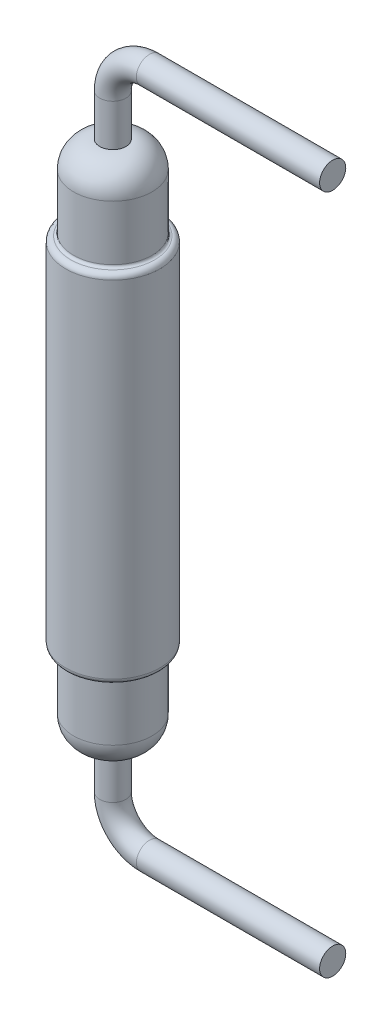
ISO-10303-21;
HEADER;
FILE_DESCRIPTION(('STEP AP214'),'2;1');
FILE_NAME('part.step','',(''),(''),'','','');
FILE_SCHEMA(('AUTOMOTIVE_DESIGN { 1 0 10303 214 1 1 1 1 }'));
ENDSEC;
DATA;
#1=APPLICATION_CONTEXT('core data for automotive mechanical design processes');
#2=APPLICATION_PROTOCOL_DEFINITION('international standard','automotive_design',2000,#1);
#3=PRODUCT_CONTEXT('',#1,'mechanical');
#4=PRODUCT('Part','Part','',(#3));
#5=PRODUCT_RELATED_PRODUCT_CATEGORY('part','',(#4));
#6=PRODUCT_DEFINITION_FORMATION('','',#4);
#7=PRODUCT_DEFINITION_CONTEXT('part definition',#1,'design');
#8=PRODUCT_DEFINITION('design','',#6,#7);
#9=PRODUCT_DEFINITION_SHAPE('','',#8);
#10=(LENGTH_UNIT() NAMED_UNIT(*) SI_UNIT(.MILLI.,.METRE.));
#11=(NAMED_UNIT(*) PLANE_ANGLE_UNIT() SI_UNIT($,.RADIAN.));
#12=(NAMED_UNIT(*) SI_UNIT($,.STERADIAN.) SOLID_ANGLE_UNIT());
#13=UNCERTAINTY_MEASURE_WITH_UNIT(LENGTH_MEASURE(1.E-05),#10,'distance_accuracy_value','');
#14=(GEOMETRIC_REPRESENTATION_CONTEXT(3) GLOBAL_UNCERTAINTY_ASSIGNED_CONTEXT((#13)) GLOBAL_UNIT_ASSIGNED_CONTEXT((#10,
#11,#12)) REPRESENTATION_CONTEXT('',''));
#15=CARTESIAN_POINT('',(0.,0.,0.));
#16=DIRECTION('',(0.,0.,1.));
#17=DIRECTION('',(1.,0.,0.));
#18=AXIS2_PLACEMENT_3D('',#15,#16,#17);
#19=CARTESIAN_POINT('',(0.,4.5,0.));
#20=DIRECTION('',(0.,-1.,0.));
#21=DIRECTION('',(0.,0.,-0.999999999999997));
#22=AXIS2_PLACEMENT_3D('',#19,#20,#21);
#23=DEGENERATE_TOROIDAL_SURFACE('',#22,0.25,0.5,.T.);
#24=CARTESIAN_POINT('',(0.,5.,0.));
#25=DIRECTION('',(0.,1.,0.));
#26=DIRECTION('',(0.,0.,0.999999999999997));
#27=AXIS2_PLACEMENT_3D('',#24,#25,#26);
#28=CIRCLE('',#27,0.25);
#29=CARTESIAN_POINT('',(0.,5.,0.249999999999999));
#30=VERTEX_POINT('',#29);
#31=EDGE_CURVE('E56',#30,#30,#28,.T.);
#32=ORIENTED_EDGE('',*,*,#31,.F.);
#33=EDGE_LOOP('',(#32));
#34=FACE_BOUND('',#33,.T.);
#35=CARTESIAN_POINT('',(0.,4.5,0.));
#36=DIRECTION('',(0.,-1.,0.));
#37=DIRECTION('',(0.,0.,-0.999999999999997));
#38=AXIS2_PLACEMENT_3D('',#35,#36,#37);
#39=CIRCLE('',#38,0.75);
#40=CARTESIAN_POINT('',(0.,4.5,-0.750000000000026));
#41=VERTEX_POINT('',#40);
#42=EDGE_CURVE('E34',#41,#41,#39,.T.);
#43=ORIENTED_EDGE('',*,*,#42,.F.);
#44=EDGE_LOOP('',(#43));
#45=FACE_BOUND('',#44,.T.);
#46=ADVANCED_FACE('F28',(#34,#45),#23,.T.);
#47=CARTESIAN_POINT('',(0.,0.,0.));
#48=DIRECTION('',(0.,-1.,0.));
#49=DIRECTION('',(0.,0.,-0.999999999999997));
#50=AXIS2_PLACEMENT_3D('',#47,#48,#49);
#51=CYLINDRICAL_SURFACE('',#50,0.75);
#52=ORIENTED_EDGE('',*,*,#42,.T.);
#53=EDGE_LOOP('',(#52));
#54=FACE_BOUND('',#53,.T.);
#55=CARTESIAN_POINT('',(0.,3.44999999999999,0.));
#56=DIRECTION('',(0.,-1.,0.));
#57=DIRECTION('',(0.,0.,-0.999999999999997));
#58=AXIS2_PLACEMENT_3D('',#55,#56,#57);
#59=CIRCLE('',#58,0.75);
#60=CARTESIAN_POINT('',(0.,3.44999999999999,-0.749999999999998));
#61=VERTEX_POINT('',#60);
#62=EDGE_CURVE('E38',#61,#61,#59,.T.);
#63=ORIENTED_EDGE('',*,*,#62,.F.);
#64=EDGE_LOOP('',(#63));
#65=FACE_BOUND('',#64,.T.);
#66=ADVANCED_FACE('F103',(#54,#65),#51,.T.);
#67=CARTESIAN_POINT('',(0.,3.44999999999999,0.));
#68=DIRECTION('',(0.,-1.,0.));
#69=DIRECTION('',(0.,0.,-0.999999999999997));
#70=AXIS2_PLACEMENT_3D('',#67,#68,#69);
#71=TOROIDAL_SURFACE('',#70,0.8,0.0500000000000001);
#72=ORIENTED_EDGE('',*,*,#62,.T.);
#73=EDGE_LOOP('',(#72));
#74=FACE_BOUND('',#73,.T.);
#75=CARTESIAN_POINT('',(0.,3.39999999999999,0.));
#76=DIRECTION('',(0.,-1.,0.));
#77=DIRECTION('',(0.,0.,-0.999999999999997));
#78=AXIS2_PLACEMENT_3D('',#75,#76,#77);
#79=CIRCLE('',#78,0.8);
#80=CARTESIAN_POINT('',(0.,3.39999999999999,-0.800000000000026));
#81=VERTEX_POINT('',#80);
#82=EDGE_CURVE('E42',#81,#81,#79,.T.);
#83=ORIENTED_EDGE('',*,*,#82,.F.);
#84=EDGE_LOOP('',(#83));
#85=FACE_BOUND('',#84,.T.);
#86=ADVANCED_FACE('F108',(#74,#85),#71,.F.);
#87=CARTESIAN_POINT('',(0.,0.,0.));
#88=DIRECTION('',(0.,-1.,0.));
#89=DIRECTION('',(0.,0.,-0.999999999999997));
#90=AXIS2_PLACEMENT_3D('',#87,#88,#89);
#91=CYLINDRICAL_SURFACE('',#90,0.9);
#92=CARTESIAN_POINT('',(0.,3.29999999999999,0.));
#93=DIRECTION('',(0.,1.,0.));
#94=DIRECTION('',(0.,0.,0.999999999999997));
#95=AXIS2_PLACEMENT_3D('',#92,#93,#94);
#96=CIRCLE('',#95,0.9);
#97=CARTESIAN_POINT('',(0.,3.29999999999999,0.899999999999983));
#98=VERTEX_POINT('',#97);
#99=EDGE_CURVE('E10',#98,#98,#96,.F.);
#100=ORIENTED_EDGE('',*,*,#99,.T.);
#101=EDGE_LOOP('',(#100));
#102=FACE_BOUND('',#101,.T.);
#103=CARTESIAN_POINT('',(0.,-3.30000000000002,0.));
#104=DIRECTION('',(0.,1.,0.));
#105=DIRECTION('',(0.,0.,0.999999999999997));
#106=AXIS2_PLACEMENT_3D('',#103,#104,#105);
#107=CIRCLE('',#106,0.9);
#108=CARTESIAN_POINT('',(0.,-3.30000000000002,0.899999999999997));
#109=VERTEX_POINT('',#108);
#110=EDGE_CURVE('E59',#109,#109,#107,.F.);
#111=ORIENTED_EDGE('',*,*,#110,.F.);
#112=EDGE_LOOP('',(#111));
#113=FACE_BOUND('',#112,.T.);
#114=ADVANCED_FACE('F136',(#102,#113),#91,.T.);
#115=CARTESIAN_POINT('',(0.,3.29999999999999,0.));
#116=DIRECTION('',(0.,1.,0.));
#117=DIRECTION('',(0.,0.,0.999999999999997));
#118=AXIS2_PLACEMENT_3D('',#115,#116,#117);
#119=TOROIDAL_SURFACE('',#118,0.8,0.1);
#120=ORIENTED_EDGE('',*,*,#82,.T.);
#121=EDGE_LOOP('',(#120));
#122=FACE_BOUND('',#121,.T.);
#123=ORIENTED_EDGE('',*,*,#99,.F.);
#124=EDGE_LOOP('',(#123));
#125=FACE_BOUND('',#124,.T.);
#126=ADVANCED_FACE('F132',(#122,#125),#119,.T.);
#127=CARTESIAN_POINT('',(0.699999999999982,6.49999999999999,0.));
#128=DIRECTION('',(0.999999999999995,0.,0.));
#129=DIRECTION('',(0.,0.,-0.999999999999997));
#130=AXIS2_PLACEMENT_3D('',#127,#128,#129);
#131=CYLINDRICAL_SURFACE('',#130,0.25);
#132=CARTESIAN_POINT('',(0.699999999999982,6.49999999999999,0.));
#133=DIRECTION('',(0.999999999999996,0.,0.));
#134=DIRECTION('',(0.,0.,0.999999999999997));
#135=AXIS2_PLACEMENT_3D('',#132,#133,#134);
#136=CIRCLE('',#135,0.25);
#137=CARTESIAN_POINT('',(0.699999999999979,6.75,0.));
#138=VERTEX_POINT('',#137);
#139=EDGE_CURVE('E50',#138,#138,#136,.T.);
#140=ORIENTED_EDGE('',*,*,#139,.T.);
#141=EDGE_LOOP('',(#140));
#142=FACE_BOUND('',#141,.T.);
#143=CARTESIAN_POINT('',(4.19999999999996,6.5,0.));
#144=DIRECTION('',(0.999999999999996,0.,0.));
#145=DIRECTION('',(0.,0.,0.999999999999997));
#146=AXIS2_PLACEMENT_3D('',#143,#144,#145);
#147=CIRCLE('',#146,0.25);
#148=CARTESIAN_POINT('',(4.19999999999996,6.5,0.249999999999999));
#149=VERTEX_POINT('',#148);
#150=EDGE_CURVE('E47',#149,#149,#147,.T.);
#151=ORIENTED_EDGE('',*,*,#150,.F.);
#152=EDGE_LOOP('',(#151));
#153=FACE_BOUND('',#152,.T.);
#154=ADVANCED_FACE('F124',(#142,#153),#131,.T.);
#155=CARTESIAN_POINT('',(0.699999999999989,5.8,0.));
#156=DIRECTION('',(0.,0.,-0.999999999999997));
#157=DIRECTION('',(-0.999999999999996,0.,0.));
#158=AXIS2_PLACEMENT_3D('',#155,#156,#157);
#159=TOROIDAL_SURFACE('',#158,0.7,0.25);
#160=CARTESIAN_POINT('',(0.,5.79999999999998,0.));
#161=DIRECTION('',(0.,1.,0.));
#162=DIRECTION('',(0.,0.,0.999999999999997));
#163=AXIS2_PLACEMENT_3D('',#160,#161,#162);
#164=CIRCLE('',#163,0.25);
#165=CARTESIAN_POINT('',(-0.250000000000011,5.79999999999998,0.));
#166=VERTEX_POINT('',#165);
#167=EDGE_CURVE('E53',#166,#166,#164,.T.);
#168=CARTESIAN_POINT('',(0.699999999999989,5.8,0.));
#169=DIRECTION('',(0.,0.,-0.999999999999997));
#170=DIRECTION('',(-0.999999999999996,0.,0.));
#171=AXIS2_PLACEMENT_3D('',#168,#169,#170);
#172=CIRCLE('',#171,0.95);
#173=EDGE_CURVE('',#166,#138,#172,.T.);
#174=ORIENTED_EDGE('',*,*,#167,.T.);
#175=ORIENTED_EDGE('',*,*,#139,.F.);
#176=ORIENTED_EDGE('',*,*,#173,.T.);
#177=ORIENTED_EDGE('',*,*,#173,.F.);
#178=EDGE_LOOP('',(#174,#176,#175,#177));
#179=FACE_BOUND('',#178,.T.);
#180=ADVANCED_FACE('F115',(#179),#159,.T.);
#181=CARTESIAN_POINT('',(0.,5.79999999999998,0.));
#182=DIRECTION('',(0.,-1.,0.));
#183=DIRECTION('',(0.,0.,-0.999999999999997));
#184=AXIS2_PLACEMENT_3D('',#181,#182,#183);
#185=CYLINDRICAL_SURFACE('',#184,0.25);
#186=ORIENTED_EDGE('',*,*,#167,.F.);
#187=EDGE_LOOP('',(#186));
#188=FACE_BOUND('',#187,.T.);
#189=ORIENTED_EDGE('',*,*,#31,.T.);
#190=EDGE_LOOP('',(#189));
#191=FACE_BOUND('',#190,.T.);
#192=ADVANCED_FACE('F112',(#188,#191),#185,.T.);
#193=CARTESIAN_POINT('',(4.19999999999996,6.5,0.));
#194=DIRECTION('',(0.999999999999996,0.,0.));
#195=DIRECTION('',(0.,0.,0.999999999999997));
#196=AXIS2_PLACEMENT_3D('',#193,#194,#195);
#197=PLANE('',#196);
#198=ORIENTED_EDGE('',*,*,#150,.T.);
#199=EDGE_LOOP('',(#198));
#200=FACE_BOUND('',#199,.T.);
#201=ADVANCED_FACE('F114',(#200),#197,.T.);
#202=CARTESIAN_POINT('',(0.,-4.50000000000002,0.));
#203=DIRECTION('',(0.,1.,0.));
#204=DIRECTION('',(0.,0.,-0.999999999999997));
#205=AXIS2_PLACEMENT_3D('',#202,#203,#204);
#206=DEGENERATE_TOROIDAL_SURFACE('',#205,0.25,0.5,.T.);
#207=CARTESIAN_POINT('',(0.,-5.00000000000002,0.));
#208=DIRECTION('',(0.,1.,0.));
#209=DIRECTION('',(0.,0.,0.999999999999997));
#210=AXIS2_PLACEMENT_3D('',#207,#208,#209);
#211=CIRCLE('',#210,0.25);
#212=CARTESIAN_POINT('',(0.,-5.00000000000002,0.249999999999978));
#213=VERTEX_POINT('',#212);
#214=EDGE_CURVE('E80',#213,#213,#211,.T.);
#215=ORIENTED_EDGE('',*,*,#214,.T.);
#216=EDGE_LOOP('',(#215));
#217=FACE_BOUND('',#216,.T.);
#218=CARTESIAN_POINT('',(0.,-4.50000000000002,0.));
#219=DIRECTION('',(0.,-1.,0.));
#220=DIRECTION('',(0.,0.,-0.999999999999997));
#221=AXIS2_PLACEMENT_3D('',#218,#219,#220);
#222=CIRCLE('',#221,0.75);
#223=CARTESIAN_POINT('',(0.,-4.50000000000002,-0.750000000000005));
#224=VERTEX_POINT('',#223);
#225=EDGE_CURVE('E62',#224,#224,#222,.T.);
#226=ORIENTED_EDGE('',*,*,#225,.T.);
#227=EDGE_LOOP('',(#226));
#228=FACE_BOUND('',#227,.T.);
#229=ADVANCED_FACE('F84',(#217,#228),#206,.T.);
#230=CARTESIAN_POINT('',(0.,0.,0.));
#231=DIRECTION('',(0.,1.,0.));
#232=DIRECTION('',(0.,0.,-0.999999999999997));
#233=AXIS2_PLACEMENT_3D('',#230,#231,#232);
#234=CYLINDRICAL_SURFACE('',#233,0.75);
#235=ORIENTED_EDGE('',*,*,#225,.F.);
#236=EDGE_LOOP('',(#235));
#237=FACE_BOUND('',#236,.T.);
#238=CARTESIAN_POINT('',(0.,-3.45000000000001,0.));
#239=DIRECTION('',(0.,-1.,0.));
#240=DIRECTION('',(0.,0.,-0.999999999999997));
#241=AXIS2_PLACEMENT_3D('',#238,#239,#240);
#242=CIRCLE('',#241,0.75);
#243=CARTESIAN_POINT('',(0.,-3.45000000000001,-0.750000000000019));
#244=VERTEX_POINT('',#243);
#245=EDGE_CURVE('E65',#244,#244,#242,.T.);
#246=ORIENTED_EDGE('',*,*,#245,.T.);
#247=EDGE_LOOP('',(#246));
#248=FACE_BOUND('',#247,.T.);
#249=ADVANCED_FACE('F186',(#237,#248),#234,.T.);
#250=CARTESIAN_POINT('',(0.,-3.45000000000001,0.));
#251=DIRECTION('',(0.,1.,0.));
#252=DIRECTION('',(0.,0.,-0.999999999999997));
#253=AXIS2_PLACEMENT_3D('',#250,#251,#252);
#254=TOROIDAL_SURFACE('',#253,0.8,0.0500000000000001);
#255=ORIENTED_EDGE('',*,*,#245,.F.);
#256=EDGE_LOOP('',(#255));
#257=FACE_BOUND('',#256,.T.);
#258=CARTESIAN_POINT('',(0.,-3.40000000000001,0.));
#259=DIRECTION('',(0.,-1.,0.));
#260=DIRECTION('',(0.,0.,-0.999999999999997));
#261=AXIS2_PLACEMENT_3D('',#258,#259,#260);
#262=CIRCLE('',#261,0.8);
#263=CARTESIAN_POINT('',(0.,-3.40000000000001,-0.800000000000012));
#264=VERTEX_POINT('',#263);
#265=EDGE_CURVE('E68',#264,#264,#262,.T.);
#266=ORIENTED_EDGE('',*,*,#265,.T.);
#267=EDGE_LOOP('',(#266));
#268=FACE_BOUND('',#267,.T.);
#269=ADVANCED_FACE('F194',(#257,#268),#254,.F.);
#270=CARTESIAN_POINT('',(0.,-3.30000000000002,0.));
#271=DIRECTION('',(0.,-1.,0.));
#272=DIRECTION('',(0.,0.,0.999999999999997));
#273=AXIS2_PLACEMENT_3D('',#270,#271,#272);
#274=TOROIDAL_SURFACE('',#273,0.8,0.1);
#275=ORIENTED_EDGE('',*,*,#265,.F.);
#276=EDGE_LOOP('',(#275));
#277=FACE_BOUND('',#276,.T.);
#278=ORIENTED_EDGE('',*,*,#110,.T.);
#279=EDGE_LOOP('',(#278));
#280=FACE_BOUND('',#279,.T.);
#281=ADVANCED_FACE('F204',(#277,#280),#274,.T.);
#282=CARTESIAN_POINT('',(0.700000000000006,-6.50000000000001,0.));
#283=DIRECTION('',(0.999999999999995,0.,0.));
#284=DIRECTION('',(0.,0.,-0.999999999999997));
#285=AXIS2_PLACEMENT_3D('',#282,#283,#284);
#286=CYLINDRICAL_SURFACE('',#285,0.25);
#287=CARTESIAN_POINT('',(0.700000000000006,-6.50000000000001,0.));
#288=DIRECTION('',(-0.999999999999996,0.,0.));
#289=DIRECTION('',(0.,0.,0.999999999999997));
#290=AXIS2_PLACEMENT_3D('',#287,#288,#289);
#291=CIRCLE('',#290,0.25);
#292=CARTESIAN_POINT('',(0.700000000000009,-6.75000000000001,0.));
#293=VERTEX_POINT('',#292);
#294=EDGE_CURVE('E74',#293,#293,#291,.T.);
#295=ORIENTED_EDGE('',*,*,#294,.F.);
#296=EDGE_LOOP('',(#295));
#297=FACE_BOUND('',#296,.T.);
#298=CARTESIAN_POINT('',(4.19999999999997,-6.50000000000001,0.));
#299=DIRECTION('',(-0.999999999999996,0.,0.));
#300=DIRECTION('',(0.,0.,0.999999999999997));
#301=AXIS2_PLACEMENT_3D('',#298,#299,#300);
#302=CIRCLE('',#301,0.25);
#303=CARTESIAN_POINT('',(4.19999999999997,-6.50000000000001,0.249999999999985));
#304=VERTEX_POINT('',#303);
#305=EDGE_CURVE('E71',#304,#304,#302,.T.);
#306=ORIENTED_EDGE('',*,*,#305,.T.);
#307=EDGE_LOOP('',(#306));
#308=FACE_BOUND('',#307,.T.);
#309=ADVANCED_FACE('F99',(#297,#308),#286,.T.);
#310=CARTESIAN_POINT('',(0.699999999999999,-5.80000000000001,0.));
#311=DIRECTION('',(0.,0.,-0.999999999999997));
#312=DIRECTION('',(-0.999999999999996,0.,0.));
#313=AXIS2_PLACEMENT_3D('',#310,#311,#312);
#314=TOROIDAL_SURFACE('',#313,0.7,0.25);
#315=CARTESIAN_POINT('',(0.,-5.80000000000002,0.));
#316=DIRECTION('',(0.,1.,0.));
#317=DIRECTION('',(0.,0.,0.999999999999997));
#318=AXIS2_PLACEMENT_3D('',#315,#316,#317);
#319=CIRCLE('',#318,0.25);
#320=CARTESIAN_POINT('',(-0.250000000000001,-5.80000000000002,0.));
#321=VERTEX_POINT('',#320);
#322=EDGE_CURVE('E77',#321,#321,#319,.T.);
#323=CARTESIAN_POINT('',(0.699999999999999,-5.80000000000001,0.));
#324=DIRECTION('',(0.,0.,-0.999999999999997));
#325=DIRECTION('',(-0.999999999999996,0.,0.));
#326=AXIS2_PLACEMENT_3D('',#323,#324,#325);
#327=CIRCLE('',#326,0.95);
#328=EDGE_CURVE('',#293,#321,#327,.T.);
#329=ORIENTED_EDGE('',*,*,#294,.T.);
#330=ORIENTED_EDGE('',*,*,#322,.F.);
#331=ORIENTED_EDGE('',*,*,#328,.T.);
#332=ORIENTED_EDGE('',*,*,#328,.F.);
#333=EDGE_LOOP('',(#329,#331,#330,#332));
#334=FACE_BOUND('',#333,.T.);
#335=ADVANCED_FACE('F90',(#334),#314,.T.);
#336=CARTESIAN_POINT('',(0.,-5.80000000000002,0.));
#337=DIRECTION('',(0.,1.,0.));
#338=DIRECTION('',(0.,0.,-0.999999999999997));
#339=AXIS2_PLACEMENT_3D('',#336,#337,#338);
#340=CYLINDRICAL_SURFACE('',#339,0.25);
#341=ORIENTED_EDGE('',*,*,#322,.T.);
#342=EDGE_LOOP('',(#341));
#343=FACE_BOUND('',#342,.T.);
#344=ORIENTED_EDGE('',*,*,#214,.F.);
#345=EDGE_LOOP('',(#344));
#346=FACE_BOUND('',#345,.T.);
#347=ADVANCED_FACE('F87',(#343,#346),#340,.T.);
#348=CARTESIAN_POINT('',(4.19999999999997,-6.50000000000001,0.));
#349=DIRECTION('',(0.999999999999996,0.,0.));
#350=DIRECTION('',(0.,0.,0.999999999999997));
#351=AXIS2_PLACEMENT_3D('',#348,#349,#350);
#352=PLANE('',#351);
#353=ORIENTED_EDGE('',*,*,#305,.F.);
#354=EDGE_LOOP('',(#353));
#355=FACE_BOUND('',#354,.T.);
#356=ADVANCED_FACE('F89',(#355),#352,.T.);
#357=CLOSED_SHELL('',(#46,#66,#86,#114,#126,#154,#180,#192,#201,#229,#249,#269,#281,#309,#335,
#347,#356));
#358=MANIFOLD_SOLID_BREP('B2',#357);
#359=ADVANCED_BREP_SHAPE_REPRESENTATION('',(#18,#358),#14);
#360=SHAPE_DEFINITION_REPRESENTATION(#9,#359);
ENDSEC;
END-ISO-10303-21;
